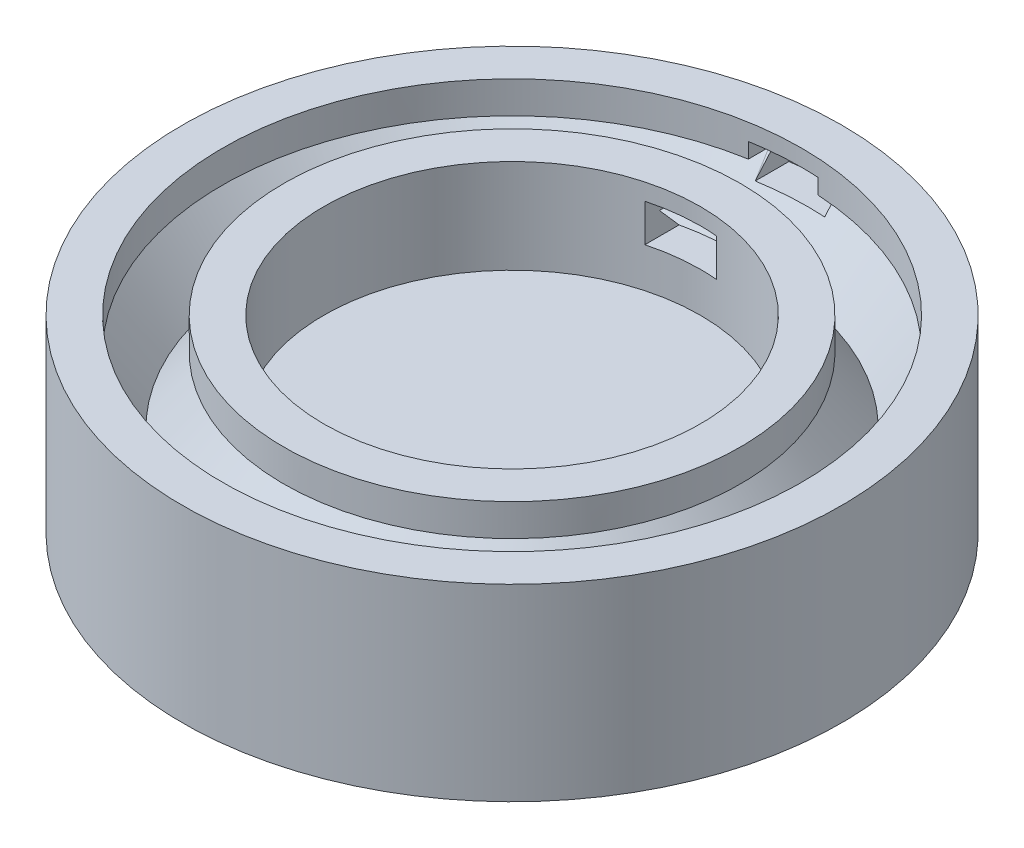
from build123d import *

# Parameters (mm, degrees)
CUT_EXTRUDE3_DEPTH      = 15
CUT_EXTRUDE3_DEPTH_BACK = 15
CUT_EXTRUDE3_START      = -30
SKETCH2_W               = 7
SKETCH2_H               = 4


with BuildPart() as part:
    # Sketch1 → Revolve1 (revolve)
    with BuildSketch(Plane.XY, mode=Mode.PRIVATE) as revolve1_sk:
        Polygon((0, 0), (35, 0), (35, 20), (30.75, 20), (30.75, 16.6), (33.5, 16.6), (27.5, 9.6), (21.5, 16.6), (24.25, 16.6), (24.25, 20), (20, 20), (20, 10), (0, 10), align=None)
    revolve(revolve1_sk.sketch.rotate(Axis((0, 0, 0), (0, 1, 0)), 90), axis=Axis((0, 0, 0), (0, 1, 0)))

    # Sketch2 → Cut-Extrude3 (cut, two sides: drawn at the far end of the back side and taken through both)
    with BuildSketch(Plane.XY.offset(CUT_EXTRUDE3_START - CUT_EXTRUDE3_DEPTH_BACK)):
        with Locations((-1.70956794, 16.22511008)):
            Rectangle(SKETCH2_W, SKETCH2_H)
    extrude(amount=CUT_EXTRUDE3_DEPTH + CUT_EXTRUDE3_DEPTH_BACK, mode=Mode.SUBTRACT)


solid = part.part
